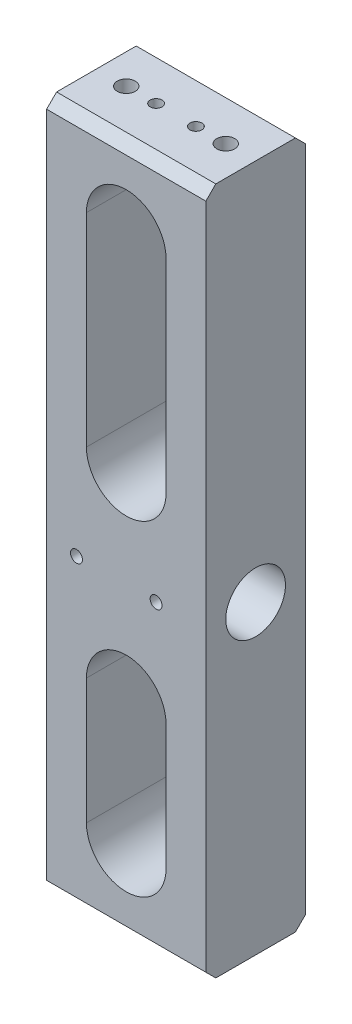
from build123d import *

# Parameters (mm, degrees)
ESQUISSE1_W                           = 80
ESQUISSE1_H                           = 345.5
BOSS_EXTRU_1_DEPTH                    = 25
CHANFREIN1_SIZE                       = 5
ESQUISSE2_R                           = 15
ENL_V_MAT_EXTRU_1_DEPTH               = 80
ESQUISSE3_R                           = 3
ENL_V_MAT_EXTRU_2_DEPTH               = 203.395652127
TROU_TARAUD_M10X1_01_D                = 9
TROU_TARAUD_M10X1_01_DEPTH            = 28
TROU_TARAUD_M10X1_01_TIP              = 2.703872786
DIAM_TRE_DU_PER_AGE_6_0_6_1_D         = 6
DIAM_TRE_DU_PER_AGE_6_0_6_1_DEPTH     = 6
DIAM_TRE_DU_PER_AGE_6_0_6_1_TIP       = 1.802581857
TROU_TARAUD_M121_D                    = 10.2
TROU_TARAUD_M121_DEPTH                = 40
TROU_TARAUD_M121_TIP                  = 3.064389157
DIAM_TRE_DU_PER_AGE_12_5_12_5_1_D     = 12.5
DIAM_TRE_DU_PER_AGE_12_5_12_5_1_DEPTH = 10
DIAM_TRE_DU_PER_AGE_12_5_12_5_1_TIP   = 3.755378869
DIAM_TRE_DU_PER_AGE_11_0_11_1_D       = 11
DIAM_TRE_DU_PER_AGE_11_0_11_1_DEPTH   = 8
DIAM_TRE_DU_PER_AGE_11_0_11_1_TIP     = 3.304733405


with BuildPart() as part:
    # Esquisse1 → Boss.-Extru.1 (new, symmetric)
    with BuildSketch(Plane.XY):
        with Locations((0, 19.25)):
            Rectangle(ESQUISSE1_W, ESQUISSE1_H)
        with BuildLine():
            Line((-20, 152), (-20, 50))
            ThreePointArc((-20, 50), (0, 30), (20, 50))
            Line((20, 50), (20, 152))
            ThreePointArc((20, 152), (0, 172), (-20, 152))
        make_face(mode=Mode.SUBTRACT)
        with BuildLine():
            Line((-20, -50.5), (-20, -113.5))
            ThreePointArc((-20, -113.5), (0, -133.5), (20, -113.5))
            Line((20, -113.5), (20, -50.5))
            ThreePointArc((20, -50.5), (0, -30.5), (-20, -50.5))
        make_face(mode=Mode.SUBTRACT)
    extrude(amount=BOSS_EXTRU_1_DEPTH, both=True)

    # Chanfrein1
    chanfrein1_edges = [part.edges().sort_by_distance(p)[0] for p in [
        (0, 192, 25),
        (0, 192, -25),
        (0, -153.5, -25),
        (0, -153.5, 25),
    ]]
    chamfer(chanfrein1_edges, length=CHANFREIN1_SIZE)

    # Esquisse2 → Enl_v. mat.-Extru.1 (cut)
    with BuildSketch(Plane.ZY.offset(40)):
        with Locations(Location((0, 0, 0), (0, 0, 270))):
            Circle(ESQUISSE2_R)
    extrude(amount=-ENL_V_MAT_EXTRU_1_DEPTH, mode=Mode.SUBTRACT)

    # Esquisse3 → Enl_v. mat.-Extru.2 (cut, through all)
    with BuildSketch(Plane(origin=(0, 0, -25), x_dir=(-1, 0, 0), z_dir=(0, 0, -1))):
        with Locations((25, 0)):
            Circle(ESQUISSE3_R)
        with Locations((-15, 0)):
            Circle(ESQUISSE3_R)
    extrude(amount=-ENL_V_MAT_EXTRU_2_DEPTH, mode=Mode.SUBTRACT)

    # Trou taraud_ M10x1.01
    with Locations(Plane(origin=(0, 192, 0), x_dir=(1, 0, 0), z_dir=(0, 1, 0))):
        with Locations((25, 0), (-25, 0)):
            Hole(TROU_TARAUD_M10X1_01_D / 2, depth=TROU_TARAUD_M10X1_01_DEPTH)
            with Locations((0, 0, -(TROU_TARAUD_M10X1_01_DEPTH + TROU_TARAUD_M10X1_01_TIP / 2))):  # 118° drill point
                Cone(0, TROU_TARAUD_M10X1_01_D / 2, TROU_TARAUD_M10X1_01_TIP, mode=Mode.SUBTRACT)

    # Diam_tre du per_age _6.0 _6_1
    with Locations(Plane(origin=(0, 192, 0), x_dir=(1, 0, 0), z_dir=(0, 1, 0))):
        with Locations((-10, 0), (10, 0)):
            Hole(DIAM_TRE_DU_PER_AGE_6_0_6_1_D / 2, depth=DIAM_TRE_DU_PER_AGE_6_0_6_1_DEPTH)
            with Locations((0, 0, -(DIAM_TRE_DU_PER_AGE_6_0_6_1_DEPTH + DIAM_TRE_DU_PER_AGE_6_0_6_1_TIP / 2))):  # 118° drill point
                Cone(0, DIAM_TRE_DU_PER_AGE_6_0_6_1_D / 2, DIAM_TRE_DU_PER_AGE_6_0_6_1_TIP, mode=Mode.SUBTRACT)

    # Trou taraud_ M121
    with Locations(Plane(origin=(0, -153.5, 0), x_dir=(-1, 0, 0), z_dir=(0, -1, 0))):
        with Locations((-28, 0)):
            Hole(TROU_TARAUD_M121_D / 2, depth=TROU_TARAUD_M121_DEPTH)
            with Locations((0, 0, -(TROU_TARAUD_M121_DEPTH + TROU_TARAUD_M121_TIP / 2))):  # 118° drill point
                Cone(0, TROU_TARAUD_M121_D / 2, TROU_TARAUD_M121_TIP, mode=Mode.SUBTRACT)

    # Diam_tre du per_age _12.5 _12.5_1
    with Locations(Plane(origin=(0, -153.5, 0), x_dir=(-1, 0, 0), z_dir=(0, -1, 0))):
        with Locations((-28, 0)):
            Hole(DIAM_TRE_DU_PER_AGE_12_5_12_5_1_D / 2, depth=DIAM_TRE_DU_PER_AGE_12_5_12_5_1_DEPTH)
            with Locations((0, 0, -(DIAM_TRE_DU_PER_AGE_12_5_12_5_1_DEPTH + DIAM_TRE_DU_PER_AGE_12_5_12_5_1_TIP / 2))):  # 118° drill point
                Cone(0, DIAM_TRE_DU_PER_AGE_12_5_12_5_1_D / 2, DIAM_TRE_DU_PER_AGE_12_5_12_5_1_TIP, mode=Mode.SUBTRACT)

    # Diam_tre du per_age _11.0 _11_1
    with Locations(Plane(origin=(0, -153.5, 0), x_dir=(-1, 0, 0), z_dir=(0, -1, 0))):
        with Locations((33, 0)):
            Hole(DIAM_TRE_DU_PER_AGE_11_0_11_1_D / 2, depth=DIAM_TRE_DU_PER_AGE_11_0_11_1_DEPTH)
            with Locations((0, 0, -(DIAM_TRE_DU_PER_AGE_11_0_11_1_DEPTH + DIAM_TRE_DU_PER_AGE_11_0_11_1_TIP / 2))):  # 118° drill point
                Cone(0, DIAM_TRE_DU_PER_AGE_11_0_11_1_D / 2, DIAM_TRE_DU_PER_AGE_11_0_11_1_TIP, mode=Mode.SUBTRACT)


solid = part.part
